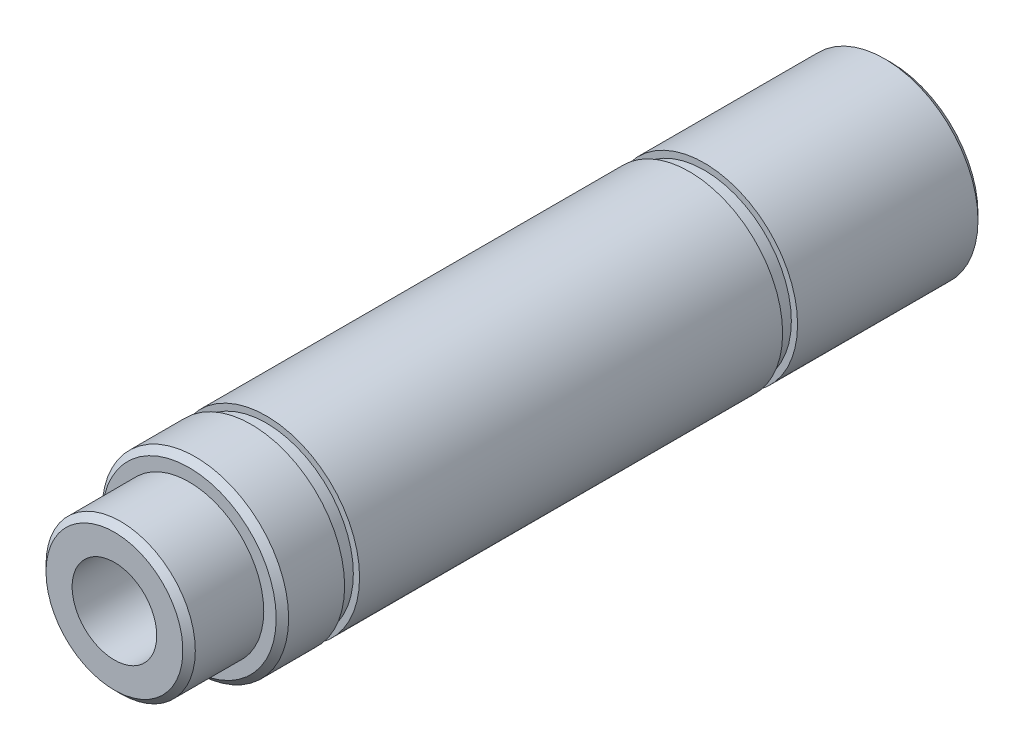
from build123d import *

# Parameters (mm, degrees)
M8_TAPPED_HOLE1_D     = 6.8
M8_TAPPED_HOLE1_DEPTH = 30
M8_TAPPED_HOLE1_TIP   = 2.042926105
CHAMFER1_SIZE         = 0.5


with BuildPart() as part:
    # Sketch1 → Revolve1 (revolve)
    with BuildSketch(Plane(origin=(0, 0, 0), x_dir=(0, 0, -1), z_dir=(1, 0, 0)), mode=Mode.PRIVATE) as revolve1_sk:
        Polygon((-31.2, 6), (-31.2, 0), (31.2, 0), (31.2, 7.5), (16.2, 7.5), (16.2, 7), (15, 7), (15, 7.5), (-19, 7.5), (-19, 7), (-20.2, 7), (-20.2, 7.5), (-25.2, 7.5), (-25.2, 6), align=None)
    revolve(revolve1_sk.sketch.rotate(Axis((0, 0, 47.712765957), (0, 0, -1)), 90), axis=Axis((0, 0, 47.712765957), (0, 0, -1)))

    # M8 Tapped Hole1
    with Locations(Plane.XY.offset(31.2)):
        with Locations((0, 0)):
            Hole(M8_TAPPED_HOLE1_D / 2, depth=M8_TAPPED_HOLE1_DEPTH)
            with Locations((0, 0, -(M8_TAPPED_HOLE1_DEPTH + M8_TAPPED_HOLE1_TIP / 2))):  # 118° drill point
                Cone(0, M8_TAPPED_HOLE1_D / 2, M8_TAPPED_HOLE1_TIP, mode=Mode.SUBTRACT)

    # Chamfer1
    chamfer1_edges = [part.edges().sort_by_distance(p)[0] for p in [
        (-7.5, 0, -31.2),
        (-7.5, 0, 25.2),
        (-6, 0, 31.2),
    ]]
    chamfer(chamfer1_edges, length=CHAMFER1_SIZE)


solid = part.part
